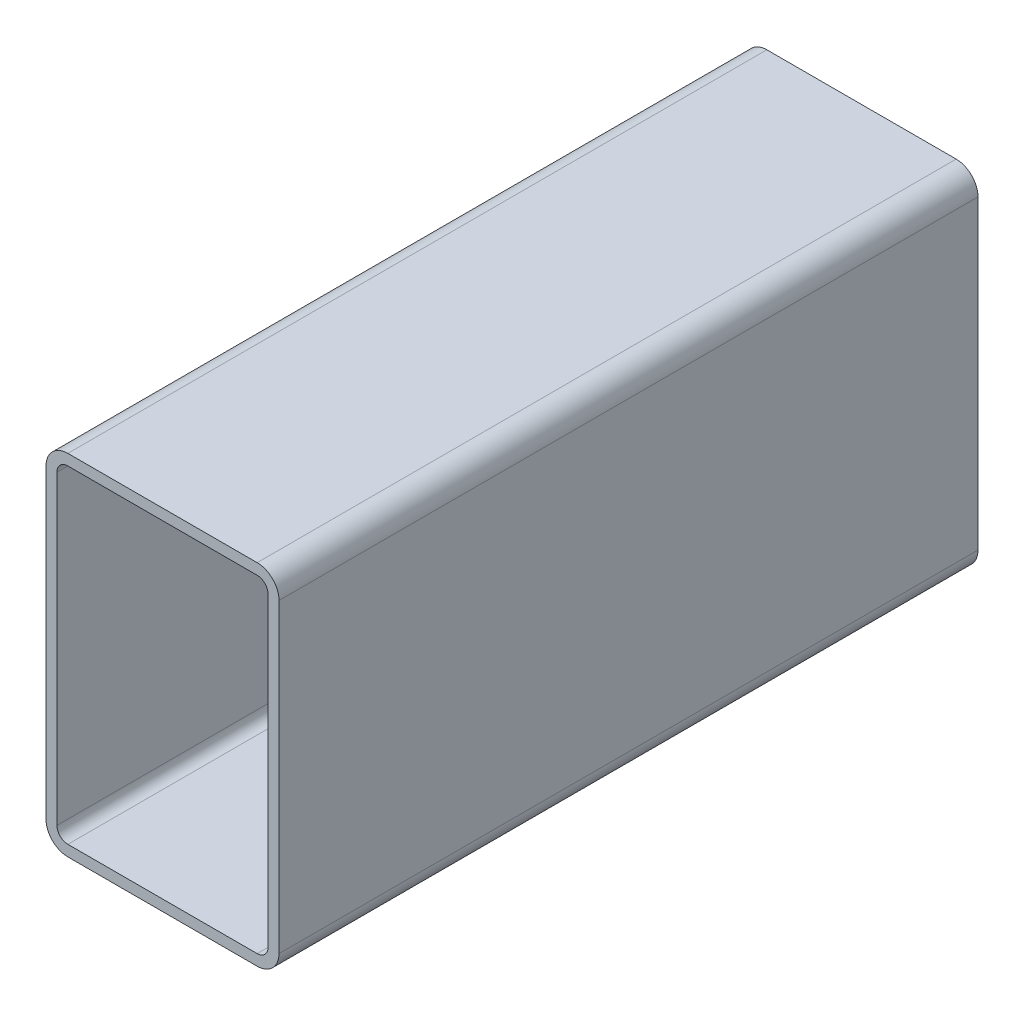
ISO-10303-21;
HEADER;
FILE_DESCRIPTION(('STEP AP214'),'2;1');
FILE_NAME('part.step','',(''),(''),'','','');
FILE_SCHEMA(('AUTOMOTIVE_DESIGN { 1 0 10303 214 1 1 1 1 }'));
ENDSEC;
DATA;
#1=APPLICATION_CONTEXT('core data for automotive mechanical design processes');
#2=APPLICATION_PROTOCOL_DEFINITION('international standard','automotive_design',2000,#1);
#3=PRODUCT_CONTEXT('',#1,'mechanical');
#4=PRODUCT('Part','Part','',(#3));
#5=PRODUCT_RELATED_PRODUCT_CATEGORY('part','',(#4));
#6=PRODUCT_DEFINITION_FORMATION('','',#4);
#7=PRODUCT_DEFINITION_CONTEXT('part definition',#1,'design');
#8=PRODUCT_DEFINITION('design','',#6,#7);
#9=PRODUCT_DEFINITION_SHAPE('','',#8);
#10=(LENGTH_UNIT() NAMED_UNIT(*) SI_UNIT(.MILLI.,.METRE.));
#11=(NAMED_UNIT(*) PLANE_ANGLE_UNIT() SI_UNIT($,.RADIAN.));
#12=(NAMED_UNIT(*) SI_UNIT($,.STERADIAN.) SOLID_ANGLE_UNIT());
#13=UNCERTAINTY_MEASURE_WITH_UNIT(LENGTH_MEASURE(1.E-05),#10,'distance_accuracy_value','');
#14=(GEOMETRIC_REPRESENTATION_CONTEXT(3) GLOBAL_UNCERTAINTY_ASSIGNED_CONTEXT((#13)) GLOBAL_UNIT_ASSIGNED_CONTEXT((#10,
#11,#12)) REPRESENTATION_CONTEXT('',''));
#15=CARTESIAN_POINT('',(0.,0.,0.));
#16=DIRECTION('',(0.,0.,1.));
#17=DIRECTION('',(1.,0.,0.));
#18=AXIS2_PLACEMENT_3D('',#15,#16,#17);
#19=CARTESIAN_POINT('',(11.2001778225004,144.886948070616,304.8));
#20=DIRECTION('',(0.,0.,1.));
#21=DIRECTION('',(1.,0.,0.));
#22=AXIS2_PLACEMENT_3D('',#19,#20,#21);
#23=PLANE('',#22);
#24=CARTESIAN_POINT('',(11.2001778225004,144.886948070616,304.8));
#25=DIRECTION('',(0.,0.,1.));
#26=DIRECTION('',(1.,0.,0.));
#27=AXIS2_PLACEMENT_3D('',#24,#25,#26);
#28=CIRCLE('',#27,9.52500000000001);
#29=CARTESIAN_POINT('',(11.2001778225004,154.411948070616,304.8));
#30=VERTEX_POINT('',#29);
#31=CARTESIAN_POINT('',(1.67517782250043,144.886948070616,304.8));
#32=VERTEX_POINT('',#31);
#33=EDGE_CURVE('E211',#30,#32,#28,.T.);
#34=ORIENTED_EDGE('',*,*,#33,.T.);
#35=DIRECTION('',(0.,-1.,0.));
#36=VECTOR('',#35,1.);
#37=CARTESIAN_POINT('',(1.67517782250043,11.5369480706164,304.8));
#38=LINE('',#37,#36);
#39=CARTESIAN_POINT('',(1.67517782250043,11.5369480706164,304.8));
#40=VERTEX_POINT('',#39);
#41=EDGE_CURVE('E214',#32,#40,#38,.T.);
#42=ORIENTED_EDGE('',*,*,#41,.T.);
#43=CARTESIAN_POINT('',(11.2001778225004,11.5369480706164,304.8));
#44=DIRECTION('',(0.,0.,1.));
#45=DIRECTION('',(1.,0.,0.));
#46=AXIS2_PLACEMENT_3D('',#43,#44,#45);
#47=CIRCLE('',#46,9.525);
#48=CARTESIAN_POINT('',(11.2001778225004,2.01194807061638,304.8));
#49=VERTEX_POINT('',#48);
#50=EDGE_CURVE('E217',#40,#49,#47,.T.);
#51=ORIENTED_EDGE('',*,*,#50,.T.);
#52=DIRECTION('',(1.,0.,0.));
#53=VECTOR('',#52,1.);
#54=CARTESIAN_POINT('',(93.7501778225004,2.01194807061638,304.8));
#55=LINE('',#54,#53);
#56=CARTESIAN_POINT('',(93.7501778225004,2.01194807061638,304.8));
#57=VERTEX_POINT('',#56);
#58=EDGE_CURVE('E219',#49,#57,#55,.T.);
#59=ORIENTED_EDGE('',*,*,#58,.T.);
#60=CARTESIAN_POINT('',(93.7501778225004,11.5369480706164,304.8));
#61=DIRECTION('',(0.,0.,1.));
#62=DIRECTION('',(1.,0.,0.));
#63=AXIS2_PLACEMENT_3D('',#60,#61,#62);
#64=CIRCLE('',#63,9.52500000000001);
#65=CARTESIAN_POINT('',(103.2751778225,11.5369480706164,304.8));
#66=VERTEX_POINT('',#65);
#67=EDGE_CURVE('E221',#57,#66,#64,.T.);
#68=ORIENTED_EDGE('',*,*,#67,.T.);
#69=DIRECTION('',(0.,1.,0.));
#70=VECTOR('',#69,1.);
#71=CARTESIAN_POINT('',(103.2751778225,144.886948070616,304.8));
#72=LINE('',#71,#70);
#73=CARTESIAN_POINT('',(103.2751778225,144.886948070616,304.8));
#74=VERTEX_POINT('',#73);
#75=EDGE_CURVE('E223',#66,#74,#72,.T.);
#76=ORIENTED_EDGE('',*,*,#75,.T.);
#77=CARTESIAN_POINT('',(93.7501778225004,144.886948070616,304.8));
#78=DIRECTION('',(0.,0.,1.));
#79=DIRECTION('',(1.,0.,0.));
#80=AXIS2_PLACEMENT_3D('',#77,#78,#79);
#81=CIRCLE('',#80,9.52500000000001);
#82=CARTESIAN_POINT('',(93.7501778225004,154.411948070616,304.8));
#83=VERTEX_POINT('',#82);
#84=EDGE_CURVE('E225',#74,#83,#81,.T.);
#85=ORIENTED_EDGE('',*,*,#84,.T.);
#86=DIRECTION('',(-1.,0.,0.));
#87=VECTOR('',#86,1.);
#88=CARTESIAN_POINT('',(11.2001778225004,154.411948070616,304.8));
#89=LINE('',#88,#87);
#90=EDGE_CURVE('E227',#83,#30,#89,.T.);
#91=ORIENTED_EDGE('',*,*,#90,.T.);
#92=EDGE_LOOP('',(#34,#42,#51,#59,#68,#76,#85,#91));
#93=FACE_BOUND('',#92,.T.);
#94=DIRECTION('',(0.,-1.,0.));
#95=VECTOR('',#94,1.);
#96=CARTESIAN_POINT('',(6.43767782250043,11.5369480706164,304.8));
#97=LINE('',#96,#95);
#98=CARTESIAN_POINT('',(6.43767782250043,144.886948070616,304.8));
#99=VERTEX_POINT('',#98);
#100=CARTESIAN_POINT('',(6.43767782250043,11.5369480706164,304.8));
#101=VERTEX_POINT('',#100);
#102=EDGE_CURVE('E154',#99,#101,#97,.T.);
#103=ORIENTED_EDGE('',*,*,#102,.F.);
#104=CARTESIAN_POINT('',(11.2001778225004,144.886948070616,304.8));
#105=DIRECTION('',(0.,0.,1.));
#106=DIRECTION('',(1.,0.,0.));
#107=AXIS2_PLACEMENT_3D('',#104,#105,#106);
#108=CIRCLE('',#107,4.76250000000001);
#109=CARTESIAN_POINT('',(11.2001778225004,149.649448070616,304.8));
#110=VERTEX_POINT('',#109);
#111=EDGE_CURVE('E146',#110,#99,#108,.T.);
#112=ORIENTED_EDGE('',*,*,#111,.F.);
#113=DIRECTION('',(-1.,0.,0.));
#114=VECTOR('',#113,1.);
#115=CARTESIAN_POINT('',(11.2001778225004,149.649448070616,304.8));
#116=LINE('',#115,#114);
#117=CARTESIAN_POINT('',(93.7501778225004,149.649448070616,304.8));
#118=VERTEX_POINT('',#117);
#119=EDGE_CURVE('E179',#118,#110,#116,.T.);
#120=ORIENTED_EDGE('',*,*,#119,.F.);
#121=CARTESIAN_POINT('',(93.7501778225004,144.886948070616,304.8));
#122=DIRECTION('',(0.,0.,1.));
#123=DIRECTION('',(1.,0.,0.));
#124=AXIS2_PLACEMENT_3D('',#121,#122,#123);
#125=CIRCLE('',#124,4.7625);
#126=CARTESIAN_POINT('',(98.5126778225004,144.886948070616,304.8));
#127=VERTEX_POINT('',#126);
#128=EDGE_CURVE('E177',#127,#118,#125,.T.);
#129=ORIENTED_EDGE('',*,*,#128,.F.);
#130=DIRECTION('',(0.,1.,0.));
#131=VECTOR('',#130,1.);
#132=CARTESIAN_POINT('',(98.5126778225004,144.886948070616,304.8));
#133=LINE('',#132,#131);
#134=CARTESIAN_POINT('',(98.5126778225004,11.5369480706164,304.8));
#135=VERTEX_POINT('',#134);
#136=EDGE_CURVE('E175',#135,#127,#133,.T.);
#137=ORIENTED_EDGE('',*,*,#136,.F.);
#138=CARTESIAN_POINT('',(93.7501778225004,11.5369480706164,304.8));
#139=DIRECTION('',(0.,0.,1.));
#140=DIRECTION('',(1.,0.,0.));
#141=AXIS2_PLACEMENT_3D('',#138,#139,#140);
#142=CIRCLE('',#141,4.7625);
#143=CARTESIAN_POINT('',(93.7501778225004,6.77444807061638,304.8));
#144=VERTEX_POINT('',#143);
#145=EDGE_CURVE('E173',#144,#135,#142,.T.);
#146=ORIENTED_EDGE('',*,*,#145,.F.);
#147=DIRECTION('',(1.,0.,0.));
#148=VECTOR('',#147,1.);
#149=CARTESIAN_POINT('',(93.7501778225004,6.77444807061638,304.8));
#150=LINE('',#149,#148);
#151=CARTESIAN_POINT('',(11.2001778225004,6.77444807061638,304.8));
#152=VERTEX_POINT('',#151);
#153=EDGE_CURVE('E169',#152,#144,#150,.T.);
#154=ORIENTED_EDGE('',*,*,#153,.F.);
#155=CARTESIAN_POINT('',(11.2001778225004,11.5369480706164,304.8));
#156=DIRECTION('',(0.,0.,1.));
#157=DIRECTION('',(1.,0.,0.));
#158=AXIS2_PLACEMENT_3D('',#155,#156,#157);
#159=CIRCLE('',#158,4.7625);
#160=EDGE_CURVE('E167',#101,#152,#159,.T.);
#161=ORIENTED_EDGE('',*,*,#160,.F.);
#162=EDGE_LOOP('',(#103,#112,#120,#129,#137,#146,#154,#161));
#163=FACE_BOUND('',#162,.T.);
#164=ADVANCED_FACE('F33',(#93,#163),#23,.T.);
#165=CARTESIAN_POINT('',(11.2001778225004,144.886948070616,0.));
#166=DIRECTION('',(0.,0.,1.));
#167=DIRECTION('',(1.,0.,0.));
#168=AXIS2_PLACEMENT_3D('',#165,#166,#167);
#169=PLANE('',#168);
#170=CARTESIAN_POINT('',(11.2001778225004,144.886948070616,0.));
#171=DIRECTION('',(0.,0.,1.));
#172=DIRECTION('',(1.,0.,0.));
#173=AXIS2_PLACEMENT_3D('',#170,#171,#172);
#174=CIRCLE('',#173,9.52500000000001);
#175=CARTESIAN_POINT('',(11.2001778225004,154.411948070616,0.));
#176=VERTEX_POINT('',#175);
#177=CARTESIAN_POINT('',(1.67517782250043,144.886948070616,0.));
#178=VERTEX_POINT('',#177);
#179=EDGE_CURVE('E162',#176,#178,#174,.T.);
#180=ORIENTED_EDGE('',*,*,#179,.F.);
#181=DIRECTION('',(-1.,0.,0.));
#182=VECTOR('',#181,1.);
#183=CARTESIAN_POINT('',(11.2001778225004,154.411948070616,0.));
#184=LINE('',#183,#182);
#185=CARTESIAN_POINT('',(93.7501778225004,154.411948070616,0.));
#186=VERTEX_POINT('',#185);
#187=EDGE_CURVE('E215',#186,#176,#184,.T.);
#188=ORIENTED_EDGE('',*,*,#187,.F.);
#189=CARTESIAN_POINT('',(93.7501778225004,144.886948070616,0.));
#190=DIRECTION('',(0.,0.,1.));
#191=DIRECTION('',(1.,0.,0.));
#192=AXIS2_PLACEMENT_3D('',#189,#190,#191);
#193=CIRCLE('',#192,9.52500000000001);
#194=CARTESIAN_POINT('',(103.2751778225,144.886948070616,0.));
#195=VERTEX_POINT('',#194);
#196=EDGE_CURVE('E242',#195,#186,#193,.T.);
#197=ORIENTED_EDGE('',*,*,#196,.F.);
#198=DIRECTION('',(0.,1.,0.));
#199=VECTOR('',#198,1.);
#200=CARTESIAN_POINT('',(103.2751778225,144.886948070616,0.));
#201=LINE('',#200,#199);
#202=CARTESIAN_POINT('',(103.2751778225,11.5369480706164,0.));
#203=VERTEX_POINT('',#202);
#204=EDGE_CURVE('E240',#203,#195,#201,.T.);
#205=ORIENTED_EDGE('',*,*,#204,.F.);
#206=CARTESIAN_POINT('',(93.7501778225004,11.5369480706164,0.));
#207=DIRECTION('',(0.,0.,1.));
#208=DIRECTION('',(1.,0.,0.));
#209=AXIS2_PLACEMENT_3D('',#206,#207,#208);
#210=CIRCLE('',#209,9.52500000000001);
#211=CARTESIAN_POINT('',(93.7501778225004,2.01194807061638,0.));
#212=VERTEX_POINT('',#211);
#213=EDGE_CURVE('E238',#212,#203,#210,.T.);
#214=ORIENTED_EDGE('',*,*,#213,.F.);
#215=DIRECTION('',(1.,0.,0.));
#216=VECTOR('',#215,1.);
#217=CARTESIAN_POINT('',(93.7501778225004,2.01194807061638,0.));
#218=LINE('',#217,#216);
#219=CARTESIAN_POINT('',(11.2001778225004,2.01194807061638,0.));
#220=VERTEX_POINT('',#219);
#221=EDGE_CURVE('E236',#220,#212,#218,.T.);
#222=ORIENTED_EDGE('',*,*,#221,.F.);
#223=CARTESIAN_POINT('',(11.2001778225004,11.5369480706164,0.));
#224=DIRECTION('',(0.,0.,1.));
#225=DIRECTION('',(1.,0.,0.));
#226=AXIS2_PLACEMENT_3D('',#223,#224,#225);
#227=CIRCLE('',#226,9.525);
#228=CARTESIAN_POINT('',(1.67517782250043,11.5369480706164,0.));
#229=VERTEX_POINT('',#228);
#230=EDGE_CURVE('E234',#229,#220,#227,.T.);
#231=ORIENTED_EDGE('',*,*,#230,.F.);
#232=DIRECTION('',(0.,-1.,0.));
#233=VECTOR('',#232,1.);
#234=CARTESIAN_POINT('',(1.67517782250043,11.5369480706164,0.));
#235=LINE('',#234,#233);
#236=EDGE_CURVE('E232',#178,#229,#235,.T.);
#237=ORIENTED_EDGE('',*,*,#236,.F.);
#238=EDGE_LOOP('',(#180,#188,#197,#205,#214,#222,#231,#237));
#239=FACE_BOUND('',#238,.T.);
#240=CARTESIAN_POINT('',(11.2001778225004,144.886948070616,0.));
#241=DIRECTION('',(0.,0.,1.));
#242=DIRECTION('',(1.,0.,0.));
#243=AXIS2_PLACEMENT_3D('',#240,#241,#242);
#244=CIRCLE('',#243,4.76250000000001);
#245=CARTESIAN_POINT('',(11.2001778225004,149.649448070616,0.));
#246=VERTEX_POINT('',#245);
#247=CARTESIAN_POINT('',(6.43767782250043,144.886948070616,0.));
#248=VERTEX_POINT('',#247);
#249=EDGE_CURVE('E56',#246,#248,#244,.T.);
#250=ORIENTED_EDGE('',*,*,#249,.T.);
#251=DIRECTION('',(0.,-1.,0.));
#252=VECTOR('',#251,1.);
#253=CARTESIAN_POINT('',(6.43767782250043,11.5369480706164,0.));
#254=LINE('',#253,#252);
#255=CARTESIAN_POINT('',(6.43767782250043,11.5369480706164,0.));
#256=VERTEX_POINT('',#255);
#257=EDGE_CURVE('E161',#248,#256,#254,.T.);
#258=ORIENTED_EDGE('',*,*,#257,.T.);
#259=CARTESIAN_POINT('',(11.2001778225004,11.5369480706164,0.));
#260=DIRECTION('',(0.,0.,1.));
#261=DIRECTION('',(1.,0.,0.));
#262=AXIS2_PLACEMENT_3D('',#259,#260,#261);
#263=CIRCLE('',#262,4.7625);
#264=CARTESIAN_POINT('',(11.2001778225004,6.77444807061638,0.));
#265=VERTEX_POINT('',#264);
#266=EDGE_CURVE('E183',#256,#265,#263,.T.);
#267=ORIENTED_EDGE('',*,*,#266,.T.);
#268=DIRECTION('',(1.,0.,0.));
#269=VECTOR('',#268,1.);
#270=CARTESIAN_POINT('',(93.7501778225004,6.77444807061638,0.));
#271=LINE('',#270,#269);
#272=CARTESIAN_POINT('',(93.7501778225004,6.77444807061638,0.));
#273=VERTEX_POINT('',#272);
#274=EDGE_CURVE('E186',#265,#273,#271,.T.);
#275=ORIENTED_EDGE('',*,*,#274,.T.);
#276=CARTESIAN_POINT('',(93.7501778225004,11.5369480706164,0.));
#277=DIRECTION('',(0.,0.,1.));
#278=DIRECTION('',(1.,0.,0.));
#279=AXIS2_PLACEMENT_3D('',#276,#277,#278);
#280=CIRCLE('',#279,4.7625);
#281=CARTESIAN_POINT('',(98.5126778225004,11.5369480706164,0.));
#282=VERTEX_POINT('',#281);
#283=EDGE_CURVE('E189',#273,#282,#280,.T.);
#284=ORIENTED_EDGE('',*,*,#283,.T.);
#285=DIRECTION('',(0.,1.,0.));
#286=VECTOR('',#285,1.);
#287=CARTESIAN_POINT('',(98.5126778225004,144.886948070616,0.));
#288=LINE('',#287,#286);
#289=CARTESIAN_POINT('',(98.5126778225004,144.886948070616,0.));
#290=VERTEX_POINT('',#289);
#291=EDGE_CURVE('E192',#282,#290,#288,.T.);
#292=ORIENTED_EDGE('',*,*,#291,.T.);
#293=CARTESIAN_POINT('',(93.7501778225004,144.886948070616,0.));
#294=DIRECTION('',(0.,0.,1.));
#295=DIRECTION('',(1.,0.,0.));
#296=AXIS2_PLACEMENT_3D('',#293,#294,#295);
#297=CIRCLE('',#296,4.7625);
#298=CARTESIAN_POINT('',(93.7501778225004,149.649448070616,0.));
#299=VERTEX_POINT('',#298);
#300=EDGE_CURVE('E195',#290,#299,#297,.T.);
#301=ORIENTED_EDGE('',*,*,#300,.T.);
#302=DIRECTION('',(-1.,0.,0.));
#303=VECTOR('',#302,1.);
#304=CARTESIAN_POINT('',(11.2001778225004,149.649448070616,0.));
#305=LINE('',#304,#303);
#306=EDGE_CURVE('E155',#299,#246,#305,.T.);
#307=ORIENTED_EDGE('',*,*,#306,.T.);
#308=EDGE_LOOP('',(#250,#258,#267,#275,#284,#292,#301,#307));
#309=FACE_BOUND('',#308,.T.);
#310=ADVANCED_FACE('F272',(#239,#309),#169,.F.);
#311=CARTESIAN_POINT('',(11.2001778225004,144.886948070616,304.8));
#312=DIRECTION('',(0.,0.,-1.));
#313=DIRECTION('',(-1.,0.,0.));
#314=AXIS2_PLACEMENT_3D('',#311,#312,#313);
#315=CYLINDRICAL_SURFACE('',#314,9.52500000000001);
#316=ORIENTED_EDGE('',*,*,#179,.T.);
#317=DIRECTION('',(0.,0.,-1.));
#318=VECTOR('',#317,1.);
#319=CARTESIAN_POINT('',(1.67517782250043,144.886948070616,304.8));
#320=LINE('',#319,#318);
#321=EDGE_CURVE('E11',#32,#178,#320,.T.);
#322=ORIENTED_EDGE('',*,*,#321,.F.);
#323=ORIENTED_EDGE('',*,*,#33,.F.);
#324=DIRECTION('',(0.,0.,-1.));
#325=VECTOR('',#324,1.);
#326=CARTESIAN_POINT('',(11.2001778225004,154.411948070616,304.8));
#327=LINE('',#326,#325);
#328=EDGE_CURVE('E229',#30,#176,#327,.T.);
#329=ORIENTED_EDGE('',*,*,#328,.T.);
#330=EDGE_LOOP('',(#316,#322,#323,#329));
#331=FACE_BOUND('',#330,.T.);
#332=ADVANCED_FACE('F35',(#331),#315,.T.);
#333=CARTESIAN_POINT('',(1.67517782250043,11.5369480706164,304.8));
#334=DIRECTION('',(1.,0.,0.));
#335=DIRECTION('',(0.,0.,-1.));
#336=AXIS2_PLACEMENT_3D('',#333,#334,#335);
#337=PLANE('',#336);
#338=ORIENTED_EDGE('',*,*,#236,.T.);
#339=DIRECTION('',(0.,0.,-1.));
#340=VECTOR('',#339,1.);
#341=CARTESIAN_POINT('',(1.67517782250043,11.5369480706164,304.8));
#342=LINE('',#341,#340);
#343=EDGE_CURVE('E41',#40,#229,#342,.T.);
#344=ORIENTED_EDGE('',*,*,#343,.F.);
#345=ORIENTED_EDGE('',*,*,#41,.F.);
#346=ORIENTED_EDGE('',*,*,#321,.T.);
#347=EDGE_LOOP('',(#338,#344,#345,#346));
#348=FACE_BOUND('',#347,.T.);
#349=ADVANCED_FACE('F289',(#348),#337,.F.);
#350=CARTESIAN_POINT('',(11.2001778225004,11.5369480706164,304.8));
#351=DIRECTION('',(0.,0.,-1.));
#352=DIRECTION('',(-1.,0.,0.));
#353=AXIS2_PLACEMENT_3D('',#350,#351,#352);
#354=CYLINDRICAL_SURFACE('',#353,9.525);
#355=ORIENTED_EDGE('',*,*,#230,.T.);
#356=DIRECTION('',(0.,0.,-1.));
#357=VECTOR('',#356,1.);
#358=CARTESIAN_POINT('',(11.2001778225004,2.01194807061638,304.8));
#359=LINE('',#358,#357);
#360=EDGE_CURVE('E259',#49,#220,#359,.T.);
#361=ORIENTED_EDGE('',*,*,#360,.F.);
#362=ORIENTED_EDGE('',*,*,#50,.F.);
#363=ORIENTED_EDGE('',*,*,#343,.T.);
#364=EDGE_LOOP('',(#355,#361,#362,#363));
#365=FACE_BOUND('',#364,.T.);
#366=ADVANCED_FACE('F266',(#365),#354,.T.);
#367=CARTESIAN_POINT('',(93.7501778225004,2.01194807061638,304.8));
#368=DIRECTION('',(0.,1.,0.));
#369=DIRECTION('',(0.,0.,1.));
#370=AXIS2_PLACEMENT_3D('',#367,#368,#369);
#371=PLANE('',#370);
#372=ORIENTED_EDGE('',*,*,#221,.T.);
#373=DIRECTION('',(0.,0.,-1.));
#374=VECTOR('',#373,1.);
#375=CARTESIAN_POINT('',(93.7501778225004,2.01194807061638,304.8));
#376=LINE('',#375,#374);
#377=EDGE_CURVE('E256',#57,#212,#376,.T.);
#378=ORIENTED_EDGE('',*,*,#377,.F.);
#379=ORIENTED_EDGE('',*,*,#58,.F.);
#380=ORIENTED_EDGE('',*,*,#360,.T.);
#381=EDGE_LOOP('',(#372,#378,#379,#380));
#382=FACE_BOUND('',#381,.T.);
#383=ADVANCED_FACE('F278',(#382),#371,.F.);
#384=CARTESIAN_POINT('',(93.7501778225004,11.5369480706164,304.8));
#385=DIRECTION('',(0.,0.,-1.));
#386=DIRECTION('',(-1.,0.,0.));
#387=AXIS2_PLACEMENT_3D('',#384,#385,#386);
#388=CYLINDRICAL_SURFACE('',#387,9.52500000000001);
#389=ORIENTED_EDGE('',*,*,#213,.T.);
#390=DIRECTION('',(0.,0.,-1.));
#391=VECTOR('',#390,1.);
#392=CARTESIAN_POINT('',(103.2751778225,11.5369480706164,304.8));
#393=LINE('',#392,#391);
#394=EDGE_CURVE('E253',#66,#203,#393,.T.);
#395=ORIENTED_EDGE('',*,*,#394,.F.);
#396=ORIENTED_EDGE('',*,*,#67,.F.);
#397=ORIENTED_EDGE('',*,*,#377,.T.);
#398=EDGE_LOOP('',(#389,#395,#396,#397));
#399=FACE_BOUND('',#398,.T.);
#400=ADVANCED_FACE('F282',(#399),#388,.T.);
#401=CARTESIAN_POINT('',(103.2751778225,144.886948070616,304.8));
#402=DIRECTION('',(-1.,0.,0.));
#403=DIRECTION('',(0.,0.,1.));
#404=AXIS2_PLACEMENT_3D('',#401,#402,#403);
#405=PLANE('',#404);
#406=ORIENTED_EDGE('',*,*,#204,.T.);
#407=DIRECTION('',(0.,0.,-1.));
#408=VECTOR('',#407,1.);
#409=CARTESIAN_POINT('',(103.2751778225,144.886948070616,304.8));
#410=LINE('',#409,#408);
#411=EDGE_CURVE('E250',#74,#195,#410,.T.);
#412=ORIENTED_EDGE('',*,*,#411,.F.);
#413=ORIENTED_EDGE('',*,*,#75,.F.);
#414=ORIENTED_EDGE('',*,*,#394,.T.);
#415=EDGE_LOOP('',(#406,#412,#413,#414));
#416=FACE_BOUND('',#415,.T.);
#417=ADVANCED_FACE('F302',(#416),#405,.F.);
#418=CARTESIAN_POINT('',(93.7501778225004,144.886948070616,304.8));
#419=DIRECTION('',(0.,0.,-1.));
#420=DIRECTION('',(-1.,0.,0.));
#421=AXIS2_PLACEMENT_3D('',#418,#419,#420);
#422=CYLINDRICAL_SURFACE('',#421,9.52500000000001);
#423=ORIENTED_EDGE('',*,*,#196,.T.);
#424=DIRECTION('',(0.,0.,-1.));
#425=VECTOR('',#424,1.);
#426=CARTESIAN_POINT('',(93.7501778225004,154.411948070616,304.8));
#427=LINE('',#426,#425);
#428=EDGE_CURVE('E247',#83,#186,#427,.T.);
#429=ORIENTED_EDGE('',*,*,#428,.F.);
#430=ORIENTED_EDGE('',*,*,#84,.F.);
#431=ORIENTED_EDGE('',*,*,#411,.T.);
#432=EDGE_LOOP('',(#423,#429,#430,#431));
#433=FACE_BOUND('',#432,.T.);
#434=ADVANCED_FACE('F300',(#433),#422,.T.);
#435=CARTESIAN_POINT('',(11.2001778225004,154.411948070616,304.8));
#436=DIRECTION('',(0.,-1.,0.));
#437=DIRECTION('',(0.,0.,-1.));
#438=AXIS2_PLACEMENT_3D('',#435,#436,#437);
#439=PLANE('',#438);
#440=ORIENTED_EDGE('',*,*,#187,.T.);
#441=ORIENTED_EDGE('',*,*,#328,.F.);
#442=ORIENTED_EDGE('',*,*,#90,.F.);
#443=ORIENTED_EDGE('',*,*,#428,.T.);
#444=EDGE_LOOP('',(#440,#441,#442,#443));
#445=FACE_BOUND('',#444,.T.);
#446=ADVANCED_FACE('F295',(#445),#439,.F.);
#447=CARTESIAN_POINT('',(11.2001778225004,144.886948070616,304.8));
#448=DIRECTION('',(0.,0.,-1.));
#449=DIRECTION('',(-1.,0.,0.));
#450=AXIS2_PLACEMENT_3D('',#447,#448,#449);
#451=CYLINDRICAL_SURFACE('',#450,4.76250000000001);
#452=ORIENTED_EDGE('',*,*,#249,.F.);
#453=DIRECTION('',(0.,0.,-1.));
#454=VECTOR('',#453,1.);
#455=CARTESIAN_POINT('',(11.2001778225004,149.649448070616,304.8));
#456=LINE('',#455,#454);
#457=EDGE_CURVE('E150',#110,#246,#456,.T.);
#458=ORIENTED_EDGE('',*,*,#457,.F.);
#459=ORIENTED_EDGE('',*,*,#111,.T.);
#460=DIRECTION('',(0.,0.,-1.));
#461=VECTOR('',#460,1.);
#462=CARTESIAN_POINT('',(6.43767782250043,144.886948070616,304.8));
#463=LINE('',#462,#461);
#464=EDGE_CURVE('E149',#99,#248,#463,.T.);
#465=ORIENTED_EDGE('',*,*,#464,.T.);
#466=EDGE_LOOP('',(#452,#458,#459,#465));
#467=FACE_BOUND('',#466,.T.);
#468=ADVANCED_FACE('F148',(#467),#451,.F.);
#469=CARTESIAN_POINT('',(6.43767782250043,11.5369480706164,304.8));
#470=DIRECTION('',(1.,0.,0.));
#471=DIRECTION('',(0.,0.,-1.));
#472=AXIS2_PLACEMENT_3D('',#469,#470,#471);
#473=PLANE('',#472);
#474=ORIENTED_EDGE('',*,*,#257,.F.);
#475=ORIENTED_EDGE('',*,*,#464,.F.);
#476=ORIENTED_EDGE('',*,*,#102,.T.);
#477=DIRECTION('',(0.,0.,-1.));
#478=VECTOR('',#477,1.);
#479=CARTESIAN_POINT('',(6.43767782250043,11.5369480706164,304.8));
#480=LINE('',#479,#478);
#481=EDGE_CURVE('E163',#101,#256,#480,.T.);
#482=ORIENTED_EDGE('',*,*,#481,.T.);
#483=EDGE_LOOP('',(#474,#475,#476,#482));
#484=FACE_BOUND('',#483,.T.);
#485=ADVANCED_FACE('F158',(#484),#473,.T.);
#486=CARTESIAN_POINT('',(11.2001778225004,11.5369480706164,304.8));
#487=DIRECTION('',(0.,0.,-1.));
#488=DIRECTION('',(-1.,0.,0.));
#489=AXIS2_PLACEMENT_3D('',#486,#487,#488);
#490=CYLINDRICAL_SURFACE('',#489,4.7625);
#491=ORIENTED_EDGE('',*,*,#266,.F.);
#492=ORIENTED_EDGE('',*,*,#481,.F.);
#493=ORIENTED_EDGE('',*,*,#160,.T.);
#494=DIRECTION('',(0.,0.,-1.));
#495=VECTOR('',#494,1.);
#496=CARTESIAN_POINT('',(11.2001778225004,6.77444807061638,304.8));
#497=LINE('',#496,#495);
#498=EDGE_CURVE('E208',#152,#265,#497,.T.);
#499=ORIENTED_EDGE('',*,*,#498,.T.);
#500=EDGE_LOOP('',(#491,#492,#493,#499));
#501=FACE_BOUND('',#500,.T.);
#502=ADVANCED_FACE('F327',(#501),#490,.F.);
#503=CARTESIAN_POINT('',(93.7501778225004,6.77444807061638,304.8));
#504=DIRECTION('',(0.,1.,0.));
#505=DIRECTION('',(0.,0.,1.));
#506=AXIS2_PLACEMENT_3D('',#503,#504,#505);
#507=PLANE('',#506);
#508=ORIENTED_EDGE('',*,*,#274,.F.);
#509=ORIENTED_EDGE('',*,*,#498,.F.);
#510=ORIENTED_EDGE('',*,*,#153,.T.);
#511=DIRECTION('',(0.,0.,-1.));
#512=VECTOR('',#511,1.);
#513=CARTESIAN_POINT('',(93.7501778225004,6.77444807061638,304.8));
#514=LINE('',#513,#512);
#515=EDGE_CURVE('E206',#144,#273,#514,.T.);
#516=ORIENTED_EDGE('',*,*,#515,.T.);
#517=EDGE_LOOP('',(#508,#509,#510,#516));
#518=FACE_BOUND('',#517,.T.);
#519=ADVANCED_FACE('F331',(#518),#507,.T.);
#520=CARTESIAN_POINT('',(93.7501778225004,11.5369480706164,304.8));
#521=DIRECTION('',(0.,0.,-1.));
#522=DIRECTION('',(-1.,0.,0.));
#523=AXIS2_PLACEMENT_3D('',#520,#521,#522);
#524=CYLINDRICAL_SURFACE('',#523,4.7625);
#525=ORIENTED_EDGE('',*,*,#283,.F.);
#526=ORIENTED_EDGE('',*,*,#515,.F.);
#527=ORIENTED_EDGE('',*,*,#145,.T.);
#528=DIRECTION('',(0.,0.,-1.));
#529=VECTOR('',#528,1.);
#530=CARTESIAN_POINT('',(98.5126778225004,11.5369480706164,304.8));
#531=LINE('',#530,#529);
#532=EDGE_CURVE('E204',#135,#282,#531,.T.);
#533=ORIENTED_EDGE('',*,*,#532,.T.);
#534=EDGE_LOOP('',(#525,#526,#527,#533));
#535=FACE_BOUND('',#534,.T.);
#536=ADVANCED_FACE('F337',(#535),#524,.F.);
#537=CARTESIAN_POINT('',(98.5126778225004,144.886948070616,304.8));
#538=DIRECTION('',(-1.,0.,0.));
#539=DIRECTION('',(0.,0.,1.));
#540=AXIS2_PLACEMENT_3D('',#537,#538,#539);
#541=PLANE('',#540);
#542=ORIENTED_EDGE('',*,*,#291,.F.);
#543=ORIENTED_EDGE('',*,*,#532,.F.);
#544=ORIENTED_EDGE('',*,*,#136,.T.);
#545=DIRECTION('',(0.,0.,-1.));
#546=VECTOR('',#545,1.);
#547=CARTESIAN_POINT('',(98.5126778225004,144.886948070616,304.8));
#548=LINE('',#547,#546);
#549=EDGE_CURVE('E202',#127,#290,#548,.T.);
#550=ORIENTED_EDGE('',*,*,#549,.T.);
#551=EDGE_LOOP('',(#542,#543,#544,#550));
#552=FACE_BOUND('',#551,.T.);
#553=ADVANCED_FACE('F341',(#552),#541,.T.);
#554=CARTESIAN_POINT('',(93.7501778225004,144.886948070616,304.8));
#555=DIRECTION('',(0.,0.,-1.));
#556=DIRECTION('',(-1.,0.,0.));
#557=AXIS2_PLACEMENT_3D('',#554,#555,#556);
#558=CYLINDRICAL_SURFACE('',#557,4.7625);
#559=ORIENTED_EDGE('',*,*,#300,.F.);
#560=ORIENTED_EDGE('',*,*,#549,.F.);
#561=ORIENTED_EDGE('',*,*,#128,.T.);
#562=DIRECTION('',(0.,0.,-1.));
#563=VECTOR('',#562,1.);
#564=CARTESIAN_POINT('',(93.7501778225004,149.649448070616,304.8));
#565=LINE('',#564,#563);
#566=EDGE_CURVE('E48',#118,#299,#565,.T.);
#567=ORIENTED_EDGE('',*,*,#566,.T.);
#568=EDGE_LOOP('',(#559,#560,#561,#567));
#569=FACE_BOUND('',#568,.T.);
#570=ADVANCED_FACE('F345',(#569),#558,.F.);
#571=CARTESIAN_POINT('',(11.2001778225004,149.649448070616,304.8));
#572=DIRECTION('',(0.,-1.,0.));
#573=DIRECTION('',(0.,0.,-1.));
#574=AXIS2_PLACEMENT_3D('',#571,#572,#573);
#575=PLANE('',#574);
#576=ORIENTED_EDGE('',*,*,#306,.F.);
#577=ORIENTED_EDGE('',*,*,#566,.F.);
#578=ORIENTED_EDGE('',*,*,#119,.T.);
#579=ORIENTED_EDGE('',*,*,#457,.T.);
#580=EDGE_LOOP('',(#576,#577,#578,#579));
#581=FACE_BOUND('',#580,.T.);
#582=ADVANCED_FACE('F349',(#581),#575,.T.);
#583=CLOSED_SHELL('',(#164,#310,#332,#349,#366,#383,#400,#417,#434,#446,#468,#485,#502,#519,
#536,#553,#570,#582));
#584=MANIFOLD_SOLID_BREP('B2',#583);
#585=ADVANCED_BREP_SHAPE_REPRESENTATION('',(#18,#584),#14);
#586=SHAPE_DEFINITION_REPRESENTATION(#9,#585);
ENDSEC;
END-ISO-10303-21;
